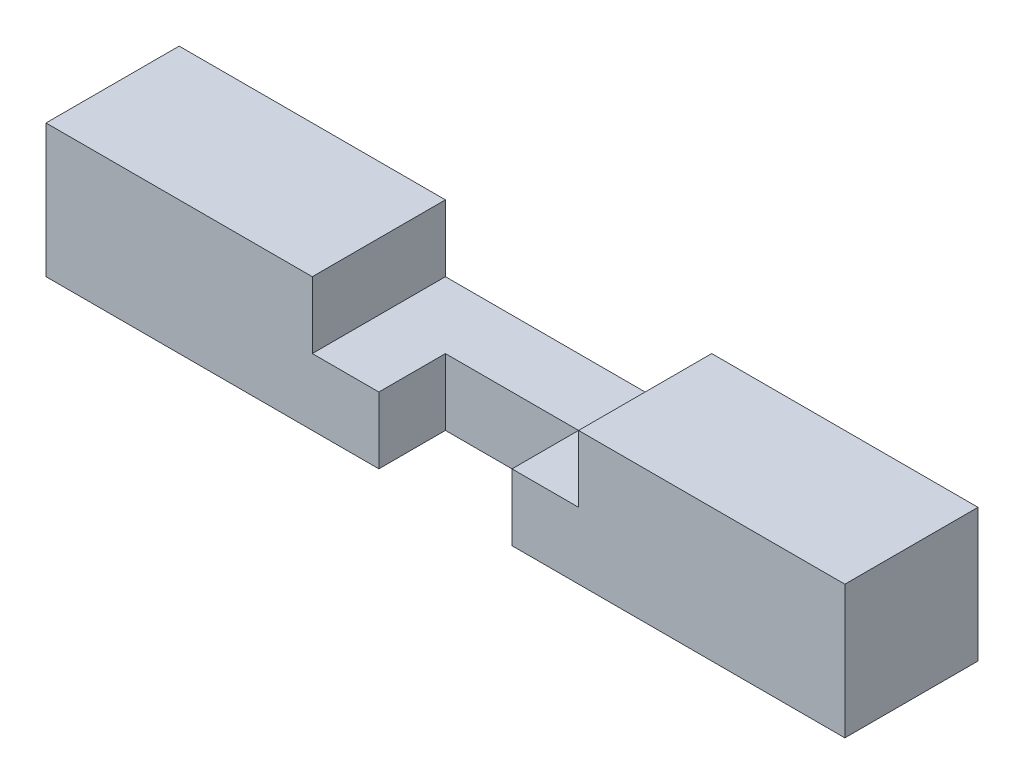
from build123d import *

# Parameters (mm, degrees)
SKETCH1_W      = 120
SKETCH1_H      = 20
EXTRUDE1_DEPTH = 20
SKETCH2_W      = 40
SKETCH2_H      = 10
EXTRUDE2_DEPTH = 124.288280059
SKETCH3_W      = 20
SKETCH3_H      = 10
EXTRUDE3_DEPTH = 123.065556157


with BuildPart() as part:
    # Sketch1 → Extrude1 (new body)
    with BuildSketch(Plane(origin=(0, 0, 0), x_dir=(1, 0, 0), z_dir=(0, 1, 0))):
        with Locations((60, 10)):
            Rectangle(SKETCH1_W, SKETCH1_H)
    extrude(amount=EXTRUDE1_DEPTH)

    # Sketch2 → Extrude2 (cut, through all)
    with BuildSketch(Plane.XY):
        with Locations((60, 15)):
            Rectangle(SKETCH2_W, SKETCH2_H)
    extrude(amount=-EXTRUDE2_DEPTH, mode=Mode.SUBTRACT)

    # Sketch3 → Extrude3 (cut, through all)
    with BuildSketch(Plane(origin=(0, 10, 0), x_dir=(1, 0, 0), z_dir=(0, 1, 0))):
        with Locations((60, 5)):
            Rectangle(SKETCH3_W, SKETCH3_H)
    extrude(amount=-EXTRUDE3_DEPTH, mode=Mode.SUBTRACT)


solid = part.part
